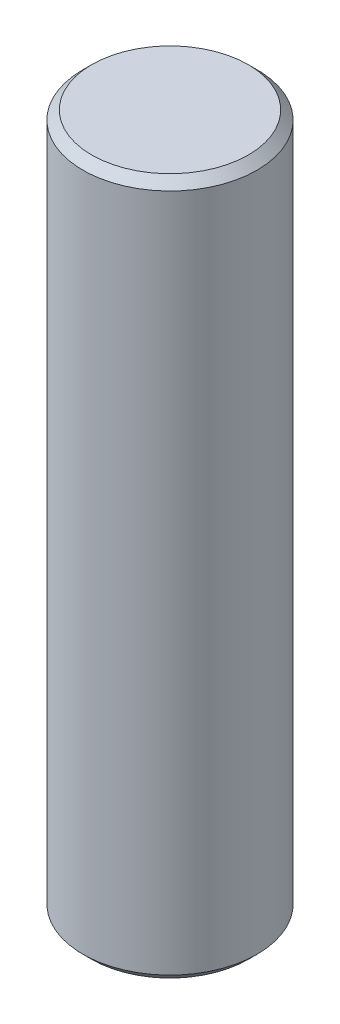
from build123d import *

# Parameters (mm, degrees)
SKETCH1_W                   = 15.875
SKETCH1_H                   = 127
CHAMFER1_SIZE               = 1.6002
F_3_8_16_TAPPED_HOLE1_D     = 7.9375
F_3_8_16_TAPPED_HOLE1_DEPTH = 20.6375
F_3_8_16_TAPPED_HOLE1_TIP   = 2.384665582


with BuildPart() as part:
    # Sketch1 → Revolve1 (revolve)
    with BuildSketch(Plane.XY, mode=Mode.PRIVATE) as revolve1_sk:
        with Locations((7.9375, 63.5)):
            Rectangle(SKETCH1_W, SKETCH1_H)
    revolve(revolve1_sk.sketch.rotate(Axis((0, 127, 0), (0, -1, 0)), 180), axis=Axis((0, 127, 0), (0, -1, 0)))

    # Chamfer1
    chamfer1_edges = [part.edges().sort_by_distance(p)[0] for p in [
        (15.875, 0, 0),
        (15.875, 127, 0),
    ]]
    chamfer(chamfer1_edges, length=CHAMFER1_SIZE)

    # 3_8-16 Tapped Hole1
    with Locations(Plane(origin=(0, 0, 0), x_dir=(-1, 0, 0), z_dir=(0, -1, 0))):
        with Locations((0, 0)):
            Hole(F_3_8_16_TAPPED_HOLE1_D / 2, depth=F_3_8_16_TAPPED_HOLE1_DEPTH)
            with Locations((0, 0, -(F_3_8_16_TAPPED_HOLE1_DEPTH + F_3_8_16_TAPPED_HOLE1_TIP / 2))):  # 118° drill point
                Cone(0, F_3_8_16_TAPPED_HOLE1_D / 2, F_3_8_16_TAPPED_HOLE1_TIP, mode=Mode.SUBTRACT)


solid = part.part
